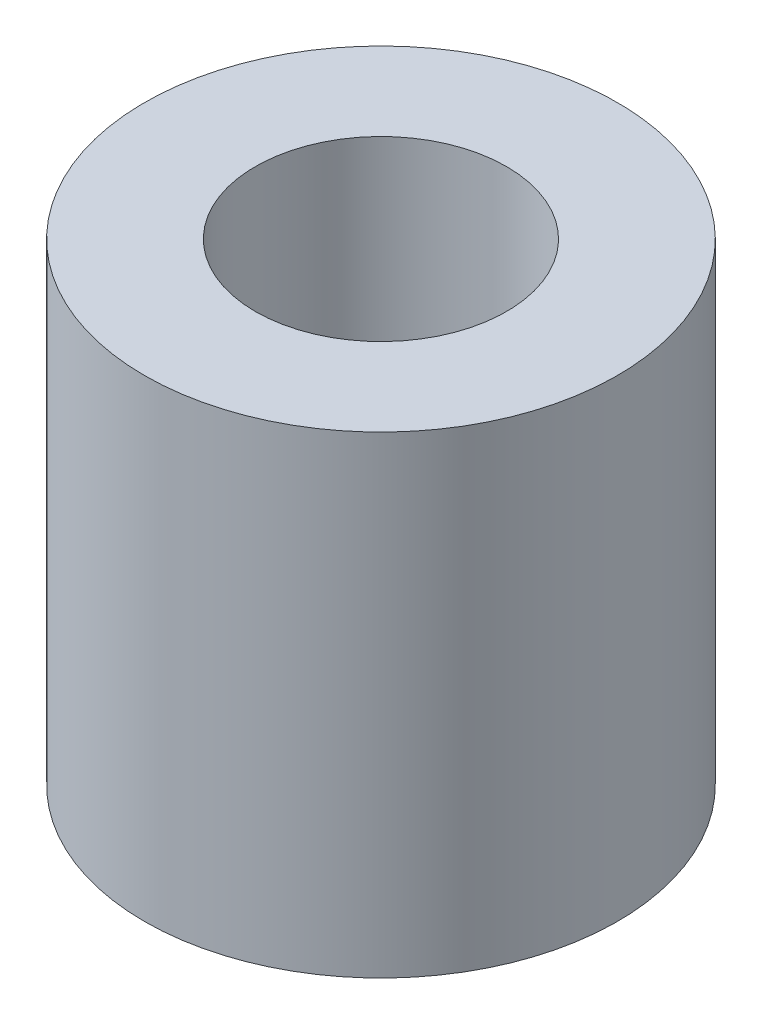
ISO-10303-21;
HEADER;
FILE_DESCRIPTION(('STEP AP214'),'2;1');
FILE_NAME('part.step','',(''),(''),'','','');
FILE_SCHEMA(('AUTOMOTIVE_DESIGN { 1 0 10303 214 1 1 1 1 }'));
ENDSEC;
DATA;
#1=APPLICATION_CONTEXT('core data for automotive mechanical design processes');
#2=APPLICATION_PROTOCOL_DEFINITION('international standard','automotive_design',2000,#1);
#3=PRODUCT_CONTEXT('',#1,'mechanical');
#4=PRODUCT('Part','Part','',(#3));
#5=PRODUCT_RELATED_PRODUCT_CATEGORY('part','',(#4));
#6=PRODUCT_DEFINITION_FORMATION('','',#4);
#7=PRODUCT_DEFINITION_CONTEXT('part definition',#1,'design');
#8=PRODUCT_DEFINITION('design','',#6,#7);
#9=PRODUCT_DEFINITION_SHAPE('','',#8);
#10=(LENGTH_UNIT() NAMED_UNIT(*) SI_UNIT(.MILLI.,.METRE.));
#11=(NAMED_UNIT(*) PLANE_ANGLE_UNIT() SI_UNIT($,.RADIAN.));
#12=(NAMED_UNIT(*) SI_UNIT($,.STERADIAN.) SOLID_ANGLE_UNIT());
#13=UNCERTAINTY_MEASURE_WITH_UNIT(LENGTH_MEASURE(1.E-05),#10,'distance_accuracy_value','');
#14=(GEOMETRIC_REPRESENTATION_CONTEXT(3) GLOBAL_UNCERTAINTY_ASSIGNED_CONTEXT((#13)) GLOBAL_UNIT_ASSIGNED_CONTEXT((#10,
#11,#12)) REPRESENTATION_CONTEXT('',''));
#15=CARTESIAN_POINT('',(0.,0.,0.));
#16=DIRECTION('',(0.,0.,1.));
#17=DIRECTION('',(1.,0.,0.));
#18=AXIS2_PLACEMENT_3D('',#15,#16,#17);
#19=CARTESIAN_POINT('',(0.,4.,0.));
#20=DIRECTION('',(0.,1.,0.));
#21=DIRECTION('',(0.,0.,1.));
#22=AXIS2_PLACEMENT_3D('',#19,#20,#21);
#23=PLANE('',#22);
#24=CARTESIAN_POINT('',(0.,4.,0.));
#25=DIRECTION('',(0.,1.,0.));
#26=DIRECTION('',(0.,0.,1.));
#27=AXIS2_PLACEMENT_3D('',#24,#25,#26);
#28=CIRCLE('',#27,4.);
#29=CARTESIAN_POINT('',(0.,4.,4.));
#30=VERTEX_POINT('',#29);
#31=EDGE_CURVE('E10',#30,#30,#28,.T.);
#32=ORIENTED_EDGE('',*,*,#31,.T.);
#33=EDGE_LOOP('',(#32));
#34=FACE_BOUND('',#33,.T.);
#35=CARTESIAN_POINT('',(0.,4.,0.));
#36=DIRECTION('',(0.,1.,0.));
#37=DIRECTION('',(0.,0.,1.));
#38=AXIS2_PLACEMENT_3D('',#35,#36,#37);
#39=CIRCLE('',#38,2.125);
#40=CARTESIAN_POINT('',(0.,4.,2.125));
#41=VERTEX_POINT('',#40);
#42=EDGE_CURVE('E43',#41,#41,#39,.T.);
#43=ORIENTED_EDGE('',*,*,#42,.F.);
#44=EDGE_LOOP('',(#43));
#45=FACE_BOUND('',#44,.T.);
#46=ADVANCED_FACE('F32',(#34,#45),#23,.T.);
#47=CARTESIAN_POINT('',(0.,-4.,0.));
#48=DIRECTION('',(0.,1.,0.));
#49=DIRECTION('',(0.,0.,1.));
#50=AXIS2_PLACEMENT_3D('',#47,#48,#49);
#51=PLANE('',#50);
#52=CARTESIAN_POINT('',(0.,-4.,0.));
#53=DIRECTION('',(0.,1.,0.));
#54=DIRECTION('',(0.,0.,1.));
#55=AXIS2_PLACEMENT_3D('',#52,#53,#54);
#56=CIRCLE('',#55,4.);
#57=CARTESIAN_POINT('',(0.,-4.,4.));
#58=VERTEX_POINT('',#57);
#59=EDGE_CURVE('E36',#58,#58,#56,.T.);
#60=ORIENTED_EDGE('',*,*,#59,.F.);
#61=EDGE_LOOP('',(#60));
#62=FACE_BOUND('',#61,.T.);
#63=CARTESIAN_POINT('',(0.,-4.,0.));
#64=DIRECTION('',(0.,1.,0.));
#65=DIRECTION('',(0.,0.,1.));
#66=AXIS2_PLACEMENT_3D('',#63,#64,#65);
#67=CIRCLE('',#66,2.125);
#68=CARTESIAN_POINT('',(0.,-4.,2.125));
#69=VERTEX_POINT('',#68);
#70=EDGE_CURVE('E45',#69,#69,#67,.T.);
#71=ORIENTED_EDGE('',*,*,#70,.T.);
#72=EDGE_LOOP('',(#71));
#73=FACE_BOUND('',#72,.T.);
#74=ADVANCED_FACE('F55',(#62,#73),#51,.F.);
#75=CARTESIAN_POINT('',(0.,4.,0.));
#76=DIRECTION('',(0.,-1.,0.));
#77=DIRECTION('',(0.,0.,-1.));
#78=AXIS2_PLACEMENT_3D('',#75,#76,#77);
#79=CYLINDRICAL_SURFACE('',#78,4.);
#80=ORIENTED_EDGE('',*,*,#31,.F.);
#81=EDGE_LOOP('',(#80));
#82=FACE_BOUND('',#81,.T.);
#83=ORIENTED_EDGE('',*,*,#59,.T.);
#84=EDGE_LOOP('',(#83));
#85=FACE_BOUND('',#84,.T.);
#86=ADVANCED_FACE('F34',(#82,#85),#79,.T.);
#87=CARTESIAN_POINT('',(0.,4.,0.));
#88=DIRECTION('',(0.,-1.,0.));
#89=DIRECTION('',(0.,0.,-1.));
#90=AXIS2_PLACEMENT_3D('',#87,#88,#89);
#91=CYLINDRICAL_SURFACE('',#90,2.125);
#92=ORIENTED_EDGE('',*,*,#42,.T.);
#93=EDGE_LOOP('',(#92));
#94=FACE_BOUND('',#93,.T.);
#95=ORIENTED_EDGE('',*,*,#70,.F.);
#96=EDGE_LOOP('',(#95));
#97=FACE_BOUND('',#96,.T.);
#98=ADVANCED_FACE('F51',(#94,#97),#91,.F.);
#99=CLOSED_SHELL('',(#46,#74,#86,#98));
#100=MANIFOLD_SOLID_BREP('B2',#99);
#101=ADVANCED_BREP_SHAPE_REPRESENTATION('',(#18,#100),#14);
#102=SHAPE_DEFINITION_REPRESENTATION(#9,#101);
ENDSEC;
END-ISO-10303-21;
